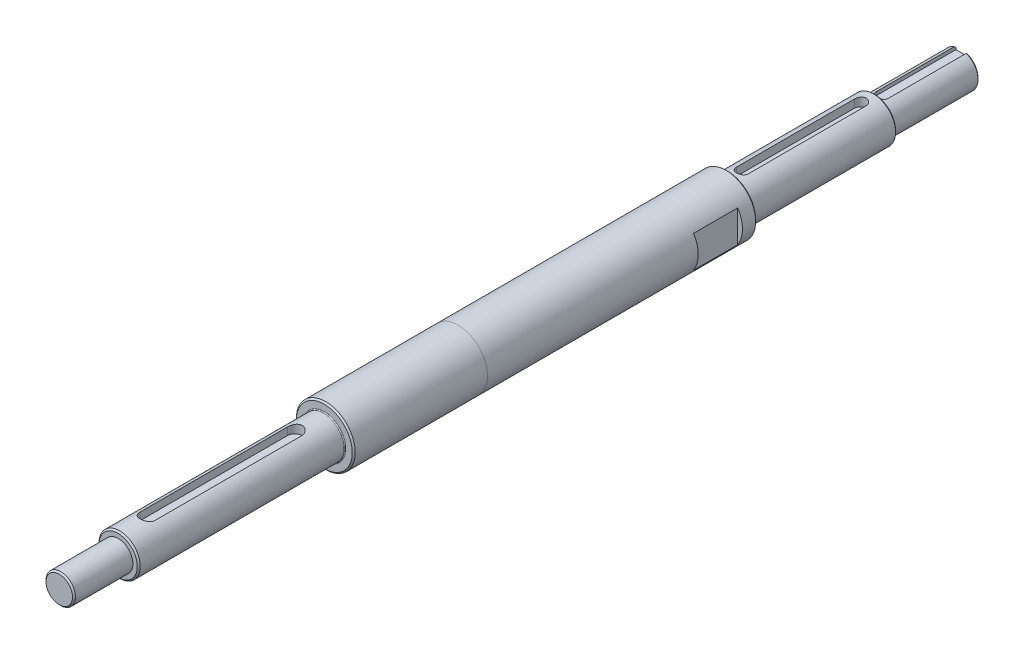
from build123d import *

# Parameters (mm, degrees)
ENL_V_MAT_EXTRU_1_DEPTH = 307.982491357
CHANFREIN1_SIZE         = 0.5
CONG_1_R                = 0.3
ENL_V_MAT_EXTRU_2_DEPTH = 10
TROU_TARAUD_M61_D       = 5
TROU_TARAUD_M61_DEPTH   = 17
TROU_TARAUD_M61_TIP     = 1.502151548
ESQUISSE7_W             = 11.176336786
ESQUISSE7_H             = 40
ESQUISSE7_H_2           = 15
ENL_V_MAT_EXTRU_3_DEPTH = 25
ENL_V_MAT_EXTRU_4_DEPTH = 1.5


with BuildPart() as part:
    # Esquisse1 → R_volution1 (revolve)
    with BuildSketch(Plane(origin=(0, 0, 0), x_dir=(0, 0, -1), z_dir=(1, 0, 0)), mode=Mode.PRIVATE) as r_volution1_sk:
        Polygon((227, 10), (90, 10), (90, 7), (20, 7), (20, 5), (0, 5), (0, 0), (306.5, 0), (306.5, 6), (277, 6), (277, 7.5), (227, 7.5), align=None)
    revolve(r_volution1_sk.sketch.rotate(Axis((0, 0, 0), (0, 0, -1)), 90), axis=Axis((0, 0, 0), (0, 0, -1)))

    # Esquisse3 → Enl_v. mat.-Extru.1 (cut, through all)
    with BuildSketch(Plane(origin=(0, 4, 0), x_dir=(-1, 0, 0), z_dir=(0, 1, 0))):
        with BuildLine():
            Line((-2.5, -30), (-2.5, -80))
            ThreePointArc((-2.5, -80), (0, -82.5), (2.5, -80))
            Line((2.5, -80), (2.5, -30))
            ThreePointArc((2.5, -30), (0, -27.5), (-2.5, -30))
        make_face()
    extrude(amount=ENL_V_MAT_EXTRU_1_DEPTH, mode=Mode.SUBTRACT)

    # Chanfrein1
    chanfrein1_edges = [part.edges().sort_by_distance(p)[0] for p in [
        (-7, 0, -20),
        (-5, 0, 0),
        (-6, 0, -306.5),
        (-7.5, 0, -277),
        (-10, 0, -227),
        (-10, 0, -90),
    ]]
    chamfer(chanfrein1_edges, length=CHANFREIN1_SIZE)

    # Cong_1
    cong_1_edges = [part.edges().sort_by_distance(p)[0] for p in [
        (-7, 0, -90),
    ]]
    fillet(cong_1_edges, radius=CONG_1_R)

    # Esquisse4 → Enl_v. mat.-Extru.2 (cut)
    with BuildSketch(Plane(origin=(0, 4.5, 0), x_dir=(-1, 0, 0), z_dir=(0, 1, 0))):
        with BuildLine():
            Line((-2, -232), (-2, -272))
            ThreePointArc((-2, -272), (0, -274), (2, -272))
            Line((2, -272), (2, -232))
            ThreePointArc((2, -232), (0, -230), (-2, -232))
        make_face()
    extrude(amount=ENL_V_MAT_EXTRU_2_DEPTH, mode=Mode.SUBTRACT)

    # Trou taraud_ M61
    with Locations(Plane(origin=(0, 0, -306.5), x_dir=(-1, 0, 0), z_dir=(0, 0, -1))):
        with Locations((0, 0)):
            Hole(TROU_TARAUD_M61_D / 2, depth=TROU_TARAUD_M61_DEPTH)
            with Locations((0, 0, -(TROU_TARAUD_M61_DEPTH + TROU_TARAUD_M61_TIP / 2))):  # 118° drill point
                Cone(0, TROU_TARAUD_M61_D / 2, TROU_TARAUD_M61_TIP, mode=Mode.SUBTRACT)

    # Esquisse7 → Enl_v. mat.-Extru.3 (cut, symmetric)
    with BuildSketch(Plane(origin=(0, 0, 0), x_dir=(1, 0, 0), z_dir=(0, 1, 0))):
        with Locations((-13.988168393, 202)):
            Rectangle(ESQUISSE7_W, ESQUISSE7_H)
        with Locations((13.988168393, 214.5)):
            Rectangle(ESQUISSE7_W, ESQUISSE7_H_2)
    extrude(amount=ENL_V_MAT_EXTRU_3_DEPTH, both=True, mode=Mode.SUBTRACT)

    # Esquisse9 → Enl_v. mat.-Extru.4 (cut)
    with BuildSketch(Plane(origin=(0, 6, -291.5), x_dir=(-1, 0, 0), z_dir=(0, 1, 0))):
        with BuildLine():
            Line((-2, -15), (2, -15))
            Line((2, -15), (2, 12))
            ThreePointArc((2, 12), (0, 14), (-2, 12))
            Line((-2, 12), (-2, -15))
        make_face()
    extrude(amount=-ENL_V_MAT_EXTRU_4_DEPTH, mode=Mode.SUBTRACT)


solid = part.part
